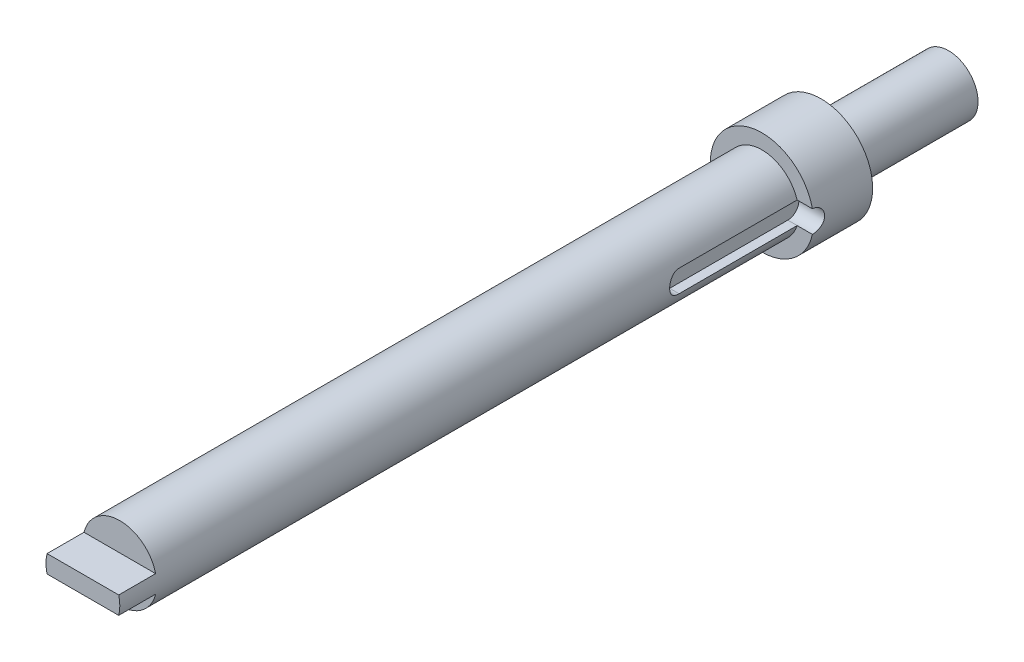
ISO-10303-21;
HEADER;
FILE_DESCRIPTION(('STEP AP214'),'2;1');
FILE_NAME('part.step','',(''),(''),'','','');
FILE_SCHEMA(('AUTOMOTIVE_DESIGN { 1 0 10303 214 1 1 1 1 }'));
ENDSEC;
DATA;
#1=APPLICATION_CONTEXT('core data for automotive mechanical design processes');
#2=APPLICATION_PROTOCOL_DEFINITION('international standard','automotive_design',2000,#1);
#3=PRODUCT_CONTEXT('',#1,'mechanical');
#4=PRODUCT('Part','Part','',(#3));
#5=PRODUCT_RELATED_PRODUCT_CATEGORY('part','',(#4));
#6=PRODUCT_DEFINITION_FORMATION('','',#4);
#7=PRODUCT_DEFINITION_CONTEXT('part definition',#1,'design');
#8=PRODUCT_DEFINITION('design','',#6,#7);
#9=PRODUCT_DEFINITION_SHAPE('','',#8);
#10=(LENGTH_UNIT() NAMED_UNIT(*) SI_UNIT(.MILLI.,.METRE.));
#11=(NAMED_UNIT(*) PLANE_ANGLE_UNIT() SI_UNIT($,.RADIAN.));
#12=(NAMED_UNIT(*) SI_UNIT($,.STERADIAN.) SOLID_ANGLE_UNIT());
#13=UNCERTAINTY_MEASURE_WITH_UNIT(LENGTH_MEASURE(1.E-05),#10,'distance_accuracy_value','');
#14=(GEOMETRIC_REPRESENTATION_CONTEXT(3) GLOBAL_UNCERTAINTY_ASSIGNED_CONTEXT((#13)) GLOBAL_UNIT_ASSIGNED_CONTEXT((#10,
#11,#12)) REPRESENTATION_CONTEXT('',''));
#15=CARTESIAN_POINT('',(0.,0.,0.));
#16=DIRECTION('',(0.,0.,1.));
#17=DIRECTION('',(1.,0.,0.));
#18=AXIS2_PLACEMENT_3D('',#15,#16,#17);
#19=CARTESIAN_POINT('',(0.,0.,138.1125));
#20=DIRECTION('',(0.,0.,1.));
#21=DIRECTION('',(1.,0.,0.));
#22=AXIS2_PLACEMENT_3D('',#19,#20,#21);
#23=PLANE('',#22);
#24=DIRECTION('',(-1.,0.,0.));
#25=VECTOR('',#24,1.);
#26=CARTESIAN_POINT('',(-7.70550979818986,1.905,138.1125));
#27=LINE('',#26,#25);
#28=CARTESIAN_POINT('',(7.70550979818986,1.905,138.1125));
#29=VERTEX_POINT('',#28);
#30=CARTESIAN_POINT('',(-7.70550979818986,1.905,138.1125));
#31=VERTEX_POINT('',#30);
#32=EDGE_CURVE('E140',#29,#31,#27,.T.);
#33=ORIENTED_EDGE('',*,*,#32,.F.);
#34=CARTESIAN_POINT('',(0.,0.,138.1125));
#35=DIRECTION('',(0.,0.,1.));
#36=DIRECTION('',(1.,0.,0.));
#37=AXIS2_PLACEMENT_3D('',#34,#35,#36);
#38=CIRCLE('',#37,7.9375);
#39=EDGE_CURVE('E72',#29,#31,#38,.T.);
#40=ORIENTED_EDGE('',*,*,#39,.T.);
#41=EDGE_LOOP('',(#33,#40));
#42=FACE_BOUND('',#41,.T.);
#43=ADVANCED_FACE('F46',(#42),#23,.T.);
#44=CARTESIAN_POINT('',(0.,0.,138.1125));
#45=DIRECTION('',(0.,0.,-1.));
#46=DIRECTION('',(-1.,0.,0.));
#47=AXIS2_PLACEMENT_3D('',#44,#45,#46);
#48=CYLINDRICAL_SURFACE('',#47,7.9375);
#49=ORIENTED_EDGE('',*,*,#39,.F.);
#50=DIRECTION('',(0.,0.,-1.));
#51=VECTOR('',#50,1.);
#52=CARTESIAN_POINT('',(7.70550979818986,1.905,146.05));
#53=LINE('',#52,#51);
#54=CARTESIAN_POINT('',(7.70550979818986,1.905,146.05));
#55=VERTEX_POINT('',#54);
#56=EDGE_CURVE('E149',#55,#29,#53,.T.);
#57=ORIENTED_EDGE('',*,*,#56,.F.);
#58=CARTESIAN_POINT('',(0.,0.,146.05));
#59=DIRECTION('',(0.,0.,1.));
#60=DIRECTION('',(-1.,0.,0.));
#61=AXIS2_PLACEMENT_3D('',#58,#59,#60);
#62=CIRCLE('',#61,7.9375);
#63=CARTESIAN_POINT('',(7.70550979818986,-1.905,146.05));
#64=VERTEX_POINT('',#63);
#65=EDGE_CURVE('E130',#64,#55,#62,.T.);
#66=ORIENTED_EDGE('',*,*,#65,.F.);
#67=DIRECTION('',(0.,0.,-1.));
#68=VECTOR('',#67,1.);
#69=CARTESIAN_POINT('',(7.70550979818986,-1.905,146.05));
#70=LINE('',#69,#68);
#71=CARTESIAN_POINT('',(7.70550979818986,-1.905,138.1125));
#72=VERTEX_POINT('',#71);
#73=EDGE_CURVE('E127',#64,#72,#70,.T.);
#74=ORIENTED_EDGE('',*,*,#73,.T.);
#75=CARTESIAN_POINT('',(-7.70550979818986,-1.905,138.1125));
#76=VERTEX_POINT('',#75);
#77=EDGE_CURVE('E143',#76,#72,#38,.T.);
#78=ORIENTED_EDGE('',*,*,#77,.F.);
#79=DIRECTION('',(0.,0.,-1.));
#80=VECTOR('',#79,1.);
#81=CARTESIAN_POINT('',(-7.70550979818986,-1.905,146.05));
#82=LINE('',#81,#80);
#83=CARTESIAN_POINT('',(-7.70550979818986,-1.905,146.05));
#84=VERTEX_POINT('',#83);
#85=EDGE_CURVE('E125',#84,#76,#82,.T.);
#86=ORIENTED_EDGE('',*,*,#85,.F.);
#87=CARTESIAN_POINT('',(0.,0.,146.05));
#88=DIRECTION('',(0.,0.,1.));
#89=DIRECTION('',(-1.,0.,0.));
#90=AXIS2_PLACEMENT_3D('',#87,#88,#89);
#91=CIRCLE('',#90,7.9375);
#92=CARTESIAN_POINT('',(-7.70550979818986,1.905,146.05));
#93=VERTEX_POINT('',#92);
#94=EDGE_CURVE('E131',#93,#84,#91,.T.);
#95=ORIENTED_EDGE('',*,*,#94,.F.);
#96=DIRECTION('',(0.,0.,-1.));
#97=VECTOR('',#96,1.);
#98=CARTESIAN_POINT('',(-7.70550979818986,1.905,146.05));
#99=LINE('',#98,#97);
#100=EDGE_CURVE('E226',#93,#31,#99,.T.);
#101=ORIENTED_EDGE('',*,*,#100,.T.);
#102=EDGE_LOOP('',(#49,#57,#66,#74,#78,#86,#95,#101));
#103=FACE_BOUND('',#102,.T.);
#104=DIRECTION('',(0.,0.,-1.));
#105=VECTOR('',#104,1.);
#106=CARTESIAN_POINT('',(7.57189241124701,-2.38125,138.1125));
#107=LINE('',#106,#105);
#108=CARTESIAN_POINT('',(7.57189241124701,-2.38125,25.4));
#109=VERTEX_POINT('',#108);
#110=CARTESIAN_POINT('',(7.57189241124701,-2.38125,0.));
#111=VERTEX_POINT('',#110);
#112=EDGE_CURVE('E184',#109,#111,#107,.T.);
#113=ORIENTED_EDGE('',*,*,#112,.F.);
#114=CARTESIAN_POINT('',(7.57189241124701,2.38125,25.4));
#115=CARTESIAN_POINT('',(7.57188330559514,2.38125815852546,25.465353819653));
#116=CARTESIAN_POINT('',(7.572738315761,2.378559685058,25.5307024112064));
#117=CARTESIAN_POINT('',(7.57610889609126,2.36781294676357,25.6609008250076));
#118=CARTESIAN_POINT('',(7.57862409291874,2.35976588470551,25.7257507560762));
#119=CARTESIAN_POINT('',(7.58523905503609,2.3384124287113,25.8543305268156));
#120=CARTESIAN_POINT('',(7.58933479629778,2.32511938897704,25.9180627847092));
#121=CARTESIAN_POINT('',(7.59897853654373,2.29340452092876,26.0441089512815));
#122=CARTESIAN_POINT('',(7.60452657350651,2.27498255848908,26.1064228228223));
#123=CARTESIAN_POINT('',(7.62310862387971,2.21224938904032,26.2905473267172));
#124=CARTESIAN_POINT('',(7.63808962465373,2.16044345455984,26.4097043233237));
#125=CARTESIAN_POINT('',(7.67153988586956,2.0384694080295,26.6376356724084));
#126=CARTESIAN_POINT('',(7.69001076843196,1.96829275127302,26.7464051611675));
#127=CARTESIAN_POINT('',(7.72901085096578,1.80919341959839,26.9539426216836));
#128=CARTESIAN_POINT('',(7.74958369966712,1.71979363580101,27.0523373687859));
#129=CARTESIAN_POINT('',(7.79009767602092,1.52580765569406,27.2329859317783));
#130=CARTESIAN_POINT('',(7.81003869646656,1.4212188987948,27.3152370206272));
#131=CARTESIAN_POINT('',(7.84754016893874,1.19714960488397,27.4628981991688));
#132=CARTESIAN_POINT('',(7.86504286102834,1.07740582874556,27.5279248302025));
#133=CARTESIAN_POINT('',(7.89518471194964,0.828073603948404,27.6367692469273));
#134=CARTESIAN_POINT('',(7.9078251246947,0.698487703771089,27.6805925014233));
#135=CARTESIAN_POINT('',(7.92650878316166,0.437077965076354,27.7445466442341));
#136=CARTESIAN_POINT('',(7.93273034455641,0.305424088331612,27.7653192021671));
#137=CARTESIAN_POINT('',(7.93850333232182,0.040359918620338,27.7846112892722));
#138=CARTESIAN_POINT('',(7.93805602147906,-0.0930500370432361,27.7831350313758));
#139=CARTESIAN_POINT('',(7.93066744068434,-0.353332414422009,27.7584012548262));
#140=CARTESIAN_POINT('',(7.92393347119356,-0.480277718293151,27.7358390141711));
#141=CARTESIAN_POINT('',(7.90498028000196,-0.728487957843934,27.6707097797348));
#142=CARTESIAN_POINT('',(7.89276077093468,-0.849752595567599,27.6281417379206));
#143=CARTESIAN_POINT('',(7.86392278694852,-1.08481465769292,27.5237380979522));
#144=CARTESIAN_POINT('',(7.84725468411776,-1.19850853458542,27.461683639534));
#145=CARTESIAN_POINT('',(7.8112877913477,-1.41409027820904,27.3202422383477));
#146=CARTESIAN_POINT('',(7.79198841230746,-1.5159754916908,27.2408514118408));
#147=CARTESIAN_POINT('',(7.75194781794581,-1.70918902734,27.0633952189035));
#148=CARTESIAN_POINT('',(7.73117969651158,-1.79996070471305,26.9647291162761));
#149=CARTESIAN_POINT('',(7.69118691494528,-1.96384496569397,26.7533478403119));
#150=CARTESIAN_POINT('',(7.67196270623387,-2.0369523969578,26.6406285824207));
#151=CARTESIAN_POINT('',(7.63710100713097,-2.1640229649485,26.4028540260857));
#152=CARTESIAN_POINT('',(7.62150171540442,-2.21778522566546,26.2776856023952));
#153=CARTESIAN_POINT('',(7.59611866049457,-2.30323844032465,26.0195623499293));
#154=CARTESIAN_POINT('',(7.58632600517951,-2.33496315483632,25.886619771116));
#155=CARTESIAN_POINT('',(7.57736026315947,-2.36380660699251,25.6936956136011));
#156=CARTESIAN_POINT('',(7.57531435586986,-2.37034709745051,25.6351234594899));
#157=CARTESIAN_POINT('',(7.57258024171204,-2.37906489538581,25.5177107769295));
#158=CARTESIAN_POINT('',(7.57189003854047,-2.38124861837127,25.4588707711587));
#159=CARTESIAN_POINT('',(7.57189241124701,-2.38125,25.4));
#160=B_SPLINE_CURVE_WITH_KNOTS('',3,(#114,#115,#116,#117,#118,#119,#120,#121,#122,#123,#124,
#125,#126,#127,#128,#129,#130,#131,#132,#133,#134,#135,#136,#137,#138,#139,#140,#141,#142,#143,
#144,#145,#146,#147,#148,#149,#150,#151,#152,#153,#154,#155,#156,#157,#158,#159),.UNSPECIFIED.,
.F.,.F.,(4,2,2,2,2,2,2,2,2,2,2,2,2,2,2,2,2,2,2,2,2,2,4),(0.,0.195991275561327,0.391938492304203,
0.587390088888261,0.782846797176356,1.17326844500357,1.5638720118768,1.96560376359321,
2.36740331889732,2.77751230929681,3.18751546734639,3.58579420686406,3.98399753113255,
4.36951721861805,4.7550571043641,5.14509213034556,5.53521462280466,5.94033955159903,
6.34558250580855,6.7549196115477,7.16362823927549,7.34039575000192,7.51690277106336),.UNSPECIFIED.);
#161=CARTESIAN_POINT('',(7.57189241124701,2.38125,25.4));
#162=VERTEX_POINT('',#161);
#163=EDGE_CURVE('E12',#162,#109,#160,.T.);
#164=ORIENTED_EDGE('',*,*,#163,.F.);
#165=DIRECTION('',(0.,0.,-1.));
#166=VECTOR('',#165,1.);
#167=CARTESIAN_POINT('',(7.57189241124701,2.38125,138.1125));
#168=LINE('',#167,#166);
#169=CARTESIAN_POINT('',(7.57189241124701,2.38125,0.));
#170=VERTEX_POINT('',#169);
#171=EDGE_CURVE('E175',#170,#162,#168,.F.);
#172=ORIENTED_EDGE('',*,*,#171,.F.);
#173=CARTESIAN_POINT('',(0.,0.,0.));
#174=DIRECTION('',(0.,0.,-1.));
#175=DIRECTION('',(-1.,0.,0.));
#176=AXIS2_PLACEMENT_3D('',#173,#174,#175);
#177=CIRCLE('',#176,7.9375);
#178=EDGE_CURVE('E270',#111,#170,#177,.T.);
#179=ORIENTED_EDGE('',*,*,#178,.F.);
#180=EDGE_LOOP('',(#113,#164,#172,#179));
#181=FACE_BOUND('',#180,.T.);
#182=ADVANCED_FACE('F48',(#103,#181),#48,.T.);
#183=CARTESIAN_POINT('',(0.,0.,-12.7));
#184=DIRECTION('',(0.,0.,1.));
#185=DIRECTION('',(1.,0.,0.));
#186=AXIS2_PLACEMENT_3D('',#183,#184,#185);
#187=CYLINDRICAL_SURFACE('',#186,11.1125);
#188=CARTESIAN_POINT('',(0.,0.,-12.7));
#189=DIRECTION('',(0.,0.,-1.));
#190=DIRECTION('',(-1.,0.,0.));
#191=AXIS2_PLACEMENT_3D('',#188,#189,#190);
#192=CIRCLE('',#191,11.1125);
#193=CARTESIAN_POINT('',(-11.1125,0.,-12.7));
#194=VERTEX_POINT('',#193);
#195=EDGE_CURVE('E274',#194,#194,#192,.T.);
#196=ORIENTED_EDGE('',*,*,#195,.F.);
#197=EDGE_LOOP('',(#196));
#198=FACE_BOUND('',#197,.T.);
#199=CARTESIAN_POINT('',(10.854368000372,-2.38125,0.));
#200=CARTESIAN_POINT('',(10.8543618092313,-2.38125730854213,-0.066153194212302));
#201=CARTESIAN_POINT('',(10.8549726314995,-2.37849340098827,-0.132302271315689));
#202=CARTESIAN_POINT('',(10.8573824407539,-2.36747986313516,-0.264111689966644));
#203=CARTESIAN_POINT('',(10.8591812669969,-2.35923097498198,-0.329772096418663));
#204=CARTESIAN_POINT('',(10.8639173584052,-2.33732213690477,-0.460034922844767));
#205=CARTESIAN_POINT('',(10.8668527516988,-2.32367108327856,-0.524638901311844));
#206=CARTESIAN_POINT('',(10.8737703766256,-2.29108037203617,-0.652423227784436));
#207=CARTESIAN_POINT('',(10.8777526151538,-2.27214067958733,-0.715603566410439));
#208=CARTESIAN_POINT('',(10.8911063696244,-2.20758188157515,-0.902353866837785));
#209=CARTESIAN_POINT('',(10.901889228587,-2.15420434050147,-1.02324348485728));
#210=CARTESIAN_POINT('',(10.9259934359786,-2.02839812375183,-1.25430846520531));
#211=CARTESIAN_POINT('',(10.9393151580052,-1.95596664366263,-1.36448224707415));
#212=CARTESIAN_POINT('',(10.9672363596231,-1.79285004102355,-1.57282654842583));
#213=CARTESIAN_POINT('',(10.9818515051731,-1.70191656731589,-1.67080088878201));
#214=CARTESIAN_POINT('',(11.0105765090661,-1.50490975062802,-1.85023180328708));
#215=CARTESIAN_POINT('',(11.0246862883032,-1.39883405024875,-1.93168580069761));
#216=CARTESIAN_POINT('',(11.0509810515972,-1.17323464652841,-2.07653956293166));
#217=CARTESIAN_POINT('',(11.063145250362,-1.05358642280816,-2.13974951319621));
#218=CARTESIAN_POINT('',(11.0839996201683,-0.805068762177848,-2.24508881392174));
#219=CARTESIAN_POINT('',(11.0926903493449,-0.676200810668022,-2.28722155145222));
#220=CARTESIAN_POINT('',(11.1055080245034,-0.414953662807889,-2.34859469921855));
#221=CARTESIAN_POINT('',(11.1097016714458,-0.282656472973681,-2.36817001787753));
#222=CARTESIAN_POINT('',(11.1132836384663,-0.0165907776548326,-2.38491922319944));
#223=CARTESIAN_POINT('',(11.1126723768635,0.11717759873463,-2.38209505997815));
#224=CARTESIAN_POINT('',(11.1067643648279,0.380075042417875,-2.3543752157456));
#225=CARTESIAN_POINT('',(11.1015443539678,0.509244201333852,-2.32984101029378));
#226=CARTESIAN_POINT('',(11.0870926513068,0.761587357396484,-2.25997308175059));
#227=CARTESIAN_POINT('',(11.0778608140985,0.884761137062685,-2.21463860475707));
#228=CARTESIAN_POINT('',(11.0562984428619,1.12263018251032,-2.10413289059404));
#229=CARTESIAN_POINT('',(11.043946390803,1.23725910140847,-2.03882320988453));
#230=CARTESIAN_POINT('',(11.0175003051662,1.45405929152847,-1.89032575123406));
#231=CARTESIAN_POINT('',(11.0034060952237,1.55622929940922,-1.80713616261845));
#232=CARTESIAN_POINT('',(10.9746961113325,1.74735249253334,-1.62328077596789));
#233=CARTESIAN_POINT('',(10.9600755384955,1.83600274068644,-1.52230058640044));
#234=CARTESIAN_POINT('',(10.9322199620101,1.99518803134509,-1.30672460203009));
#235=CARTESIAN_POINT('',(10.9189853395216,2.06571809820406,-1.19212508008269));
#236=CARTESIAN_POINT('',(10.8953858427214,2.18679116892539,-0.952069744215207));
#237=CARTESIAN_POINT('',(10.8850305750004,2.23726750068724,-0.826579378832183));
#238=CARTESIAN_POINT('',(10.8684986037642,2.31625785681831,-0.568703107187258));
#239=CARTESIAN_POINT('',(10.8623156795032,2.34480458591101,-0.436327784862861));
#240=CARTESIAN_POINT('',(10.8571845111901,2.36838059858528,-0.252391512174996));
#241=CARTESIAN_POINT('',(10.8561295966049,2.37320809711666,-0.201996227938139));
#242=CARTESIAN_POINT('',(10.8547218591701,2.37963885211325,-0.101074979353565));
#243=CARTESIAN_POINT('',(10.8543678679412,2.38124747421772,-0.0505493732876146));
#244=CARTESIAN_POINT('',(10.854368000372,2.38125,0.));
#245=B_SPLINE_CURVE_WITH_KNOTS('',3,(#199,#200,#201,#202,#203,#204,#205,#206,#207,#208,#209,
#210,#211,#212,#213,#214,#215,#216,#217,#218,#219,#220,#221,#222,#223,#224,#225,#226,#227,#228,
#229,#230,#231,#232,#233,#234,#235,#236,#237,#238,#239,#240,#241,#242,#243,#244),.UNSPECIFIED.,
.F.,.F.,(4,2,2,2,2,2,2,2,2,2,2,2,2,2,2,2,2,2,2,2,2,2,4),(0.,0.198391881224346,0.396756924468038,
0.594796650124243,0.792837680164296,1.18858787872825,1.58439635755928,1.98591716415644,
2.38750054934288,2.79312275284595,3.19867975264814,3.5981345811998,3.99755463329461,
4.39044684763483,4.78335330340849,5.1790470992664,5.57478098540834,5.97837765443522,
6.38208502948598,6.78712358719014,7.19155691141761,7.34338415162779,7.4949580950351),.UNSPECIFIED.);
#246=CARTESIAN_POINT('',(10.854368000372,-2.38125,0.));
#247=VERTEX_POINT('',#246);
#248=CARTESIAN_POINT('',(10.854368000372,2.38125,0.));
#249=VERTEX_POINT('',#248);
#250=EDGE_CURVE('E177',#247,#249,#245,.T.);
#251=ORIENTED_EDGE('',*,*,#250,.F.);
#252=CARTESIAN_POINT('',(0.,0.,0.));
#253=DIRECTION('',(0.,0.,-1.));
#254=DIRECTION('',(-1.,0.,0.));
#255=AXIS2_PLACEMENT_3D('',#252,#253,#254);
#256=CIRCLE('',#255,11.1125);
#257=EDGE_CURVE('E277',#247,#249,#256,.T.);
#258=ORIENTED_EDGE('',*,*,#257,.T.);
#259=EDGE_LOOP('',(#251,#258));
#260=FACE_BOUND('',#259,.T.);
#261=ADVANCED_FACE('F186',(#198,#260),#187,.T.);
#262=CARTESIAN_POINT('',(0.,0.,0.));
#263=DIRECTION('',(0.,0.,-1.));
#264=DIRECTION('',(-1.,0.,0.));
#265=AXIS2_PLACEMENT_3D('',#262,#263,#264);
#266=PLANE('',#265);
#267=DIRECTION('',(-1.,0.,0.));
#268=VECTOR('',#267,1.);
#269=CARTESIAN_POINT('',(11.1125,-2.38125,0.));
#270=LINE('',#269,#268);
#271=EDGE_CURVE('E59',#111,#247,#270,.F.);
#272=ORIENTED_EDGE('',*,*,#271,.F.);
#273=ORIENTED_EDGE('',*,*,#178,.T.);
#274=DIRECTION('',(-1.,0.,0.));
#275=VECTOR('',#274,1.);
#276=CARTESIAN_POINT('',(0.,2.38125,0.));
#277=LINE('',#276,#275);
#278=EDGE_CURVE('E227',#249,#170,#277,.T.);
#279=ORIENTED_EDGE('',*,*,#278,.F.);
#280=ORIENTED_EDGE('',*,*,#257,.F.);
#281=EDGE_LOOP('',(#272,#273,#279,#280));
#282=FACE_BOUND('',#281,.T.);
#283=ADVANCED_FACE('F209',(#282),#266,.F.);
#284=DIRECTION('',(1.,0.,0.));
#285=VECTOR('',#284,1.);
#286=CARTESIAN_POINT('',(-7.70550979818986,-1.905,138.1125));
#287=LINE('',#286,#285);
#288=EDGE_CURVE('E65',#76,#72,#287,.T.);
#289=ORIENTED_EDGE('',*,*,#288,.F.);
#290=ORIENTED_EDGE('',*,*,#77,.T.);
#291=EDGE_LOOP('',(#289,#290));
#292=FACE_BOUND('',#291,.T.);
#293=ADVANCED_FACE('F207',(#292),#23,.T.);
#294=CARTESIAN_POINT('',(0.,0.,-12.7));
#295=DIRECTION('',(0.,0.,-1.));
#296=DIRECTION('',(-1.,0.,0.));
#297=AXIS2_PLACEMENT_3D('',#294,#295,#296);
#298=PLANE('',#297);
#299=CARTESIAN_POINT('',(0.,0.,-12.7));
#300=DIRECTION('',(0.,0.,-1.));
#301=DIRECTION('',(-1.,0.,0.));
#302=AXIS2_PLACEMENT_3D('',#299,#300,#301);
#303=CIRCLE('',#302,6.35);
#304=CARTESIAN_POINT('',(-6.35,0.,-12.7));
#305=VERTEX_POINT('',#304);
#306=EDGE_CURVE('E144',#305,#305,#303,.T.);
#307=ORIENTED_EDGE('',*,*,#306,.F.);
#308=EDGE_LOOP('',(#307));
#309=FACE_BOUND('',#308,.T.);
#310=ORIENTED_EDGE('',*,*,#195,.T.);
#311=EDGE_LOOP('',(#310));
#312=FACE_BOUND('',#311,.T.);
#313=ADVANCED_FACE('F204',(#309,#312),#298,.T.);
#314=CARTESIAN_POINT('',(11.1125,0.,25.4));
#315=DIRECTION('',(-1.,0.,0.));
#316=DIRECTION('',(0.,0.,1.));
#317=AXIS2_PLACEMENT_3D('',#314,#315,#316);
#318=CYLINDRICAL_SURFACE('',#317,2.38125);
#319=ORIENTED_EDGE('',*,*,#163,.T.);
#320=DIRECTION('',(-1.,0.,0.));
#321=VECTOR('',#320,1.);
#322=CARTESIAN_POINT('',(11.1125,-2.38125,25.4));
#323=LINE('',#322,#321);
#324=CARTESIAN_POINT('',(5.55625,-2.38125,25.4));
#325=VERTEX_POINT('',#324);
#326=EDGE_CURVE('E173',#109,#325,#323,.T.);
#327=ORIENTED_EDGE('',*,*,#326,.T.);
#328=CARTESIAN_POINT('',(5.55625,0.,25.4));
#329=DIRECTION('',(1.,0.,0.));
#330=DIRECTION('',(0.,0.,-1.));
#331=AXIS2_PLACEMENT_3D('',#328,#329,#330);
#332=CIRCLE('',#331,2.38125);
#333=CARTESIAN_POINT('',(5.55625,2.38125,25.4));
#334=VERTEX_POINT('',#333);
#335=EDGE_CURVE('E154',#334,#325,#332,.T.);
#336=ORIENTED_EDGE('',*,*,#335,.F.);
#337=DIRECTION('',(-1.,0.,0.));
#338=VECTOR('',#337,1.);
#339=CARTESIAN_POINT('',(11.1125,2.38125,25.4));
#340=LINE('',#339,#338);
#341=EDGE_CURVE('E167',#162,#334,#340,.T.);
#342=ORIENTED_EDGE('',*,*,#341,.F.);
#343=EDGE_LOOP('',(#319,#327,#336,#342));
#344=FACE_BOUND('',#343,.T.);
#345=ADVANCED_FACE('F199',(#344),#318,.F.);
#346=CARTESIAN_POINT('',(11.1125,-2.38125,25.4));
#347=DIRECTION('',(0.,1.,0.));
#348=DIRECTION('',(0.,0.,1.));
#349=AXIS2_PLACEMENT_3D('',#346,#347,#348);
#350=PLANE('',#349);
#351=ORIENTED_EDGE('',*,*,#112,.T.);
#352=DIRECTION('',(-1.,0.,0.));
#353=VECTOR('',#352,1.);
#354=CARTESIAN_POINT('',(11.1125,-2.38125,0.));
#355=LINE('',#354,#353);
#356=CARTESIAN_POINT('',(5.55625,-2.38125,0.));
#357=VERTEX_POINT('',#356);
#358=EDGE_CURVE('E171',#111,#357,#355,.T.);
#359=ORIENTED_EDGE('',*,*,#358,.T.);
#360=DIRECTION('',(0.,0.,-1.));
#361=VECTOR('',#360,1.);
#362=CARTESIAN_POINT('',(5.55625,-2.38125,25.4));
#363=LINE('',#362,#361);
#364=EDGE_CURVE('E158',#325,#357,#363,.T.);
#365=ORIENTED_EDGE('',*,*,#364,.F.);
#366=ORIENTED_EDGE('',*,*,#326,.F.);
#367=EDGE_LOOP('',(#351,#359,#365,#366));
#368=FACE_BOUND('',#367,.T.);
#369=ADVANCED_FACE('F195',(#368),#350,.T.);
#370=CARTESIAN_POINT('',(11.1125,0.,0.));
#371=DIRECTION('',(-1.,0.,0.));
#372=DIRECTION('',(0.,0.,1.));
#373=AXIS2_PLACEMENT_3D('',#370,#371,#372);
#374=CYLINDRICAL_SURFACE('',#373,2.38125);
#375=ORIENTED_EDGE('',*,*,#250,.T.);
#376=ORIENTED_EDGE('',*,*,#278,.T.);
#377=DIRECTION('',(-1.,0.,0.));
#378=VECTOR('',#377,1.);
#379=CARTESIAN_POINT('',(11.1125,2.38125,0.));
#380=LINE('',#379,#378);
#381=CARTESIAN_POINT('',(5.55625,2.38125,0.));
#382=VERTEX_POINT('',#381);
#383=EDGE_CURVE('E169',#170,#382,#380,.T.);
#384=ORIENTED_EDGE('',*,*,#383,.T.);
#385=CARTESIAN_POINT('',(5.55625,0.,0.));
#386=DIRECTION('',(1.,0.,0.));
#387=DIRECTION('',(0.,0.,-1.));
#388=AXIS2_PLACEMENT_3D('',#385,#386,#387);
#389=CIRCLE('',#388,2.38125);
#390=EDGE_CURVE('E161',#357,#382,#389,.T.);
#391=ORIENTED_EDGE('',*,*,#390,.F.);
#392=ORIENTED_EDGE('',*,*,#358,.F.);
#393=ORIENTED_EDGE('',*,*,#271,.T.);
#394=EDGE_LOOP('',(#375,#376,#384,#391,#392,#393));
#395=FACE_BOUND('',#394,.T.);
#396=ADVANCED_FACE('F189',(#395),#374,.F.);
#397=CARTESIAN_POINT('',(11.1125,2.38125,25.4));
#398=DIRECTION('',(0.,-1.,0.));
#399=DIRECTION('',(0.,0.,-1.));
#400=AXIS2_PLACEMENT_3D('',#397,#398,#399);
#401=PLANE('',#400);
#402=ORIENTED_EDGE('',*,*,#171,.T.);
#403=ORIENTED_EDGE('',*,*,#341,.T.);
#404=DIRECTION('',(0.,0.,1.));
#405=VECTOR('',#404,1.);
#406=CARTESIAN_POINT('',(5.55625,2.38125,25.4));
#407=LINE('',#406,#405);
#408=EDGE_CURVE('E164',#382,#334,#407,.T.);
#409=ORIENTED_EDGE('',*,*,#408,.F.);
#410=ORIENTED_EDGE('',*,*,#383,.F.);
#411=EDGE_LOOP('',(#402,#403,#409,#410));
#412=FACE_BOUND('',#411,.T.);
#413=ADVANCED_FACE('F194',(#412),#401,.T.);
#414=CARTESIAN_POINT('',(5.55625,0.,25.4));
#415=DIRECTION('',(1.,0.,0.));
#416=DIRECTION('',(0.,0.,-1.));
#417=AXIS2_PLACEMENT_3D('',#414,#415,#416);
#418=PLANE('',#417);
#419=ORIENTED_EDGE('',*,*,#335,.T.);
#420=ORIENTED_EDGE('',*,*,#364,.T.);
#421=ORIENTED_EDGE('',*,*,#390,.T.);
#422=ORIENTED_EDGE('',*,*,#408,.T.);
#423=EDGE_LOOP('',(#419,#420,#421,#422));
#424=FACE_BOUND('',#423,.T.);
#425=ADVANCED_FACE('F249',(#424),#418,.T.);
#426=CARTESIAN_POINT('',(0.,0.,-40.132));
#427=DIRECTION('',(0.,0.,1.));
#428=DIRECTION('',(1.,0.,0.));
#429=AXIS2_PLACEMENT_3D('',#426,#427,#428);
#430=CYLINDRICAL_SURFACE('',#429,6.35);
#431=CARTESIAN_POINT('',(0.,0.,-40.132));
#432=DIRECTION('',(0.,0.,-1.));
#433=DIRECTION('',(-1.,0.,0.));
#434=AXIS2_PLACEMENT_3D('',#431,#432,#433);
#435=CIRCLE('',#434,6.35);
#436=CARTESIAN_POINT('',(-6.35,0.,-40.132));
#437=VERTEX_POINT('',#436);
#438=EDGE_CURVE('E147',#437,#437,#435,.T.);
#439=ORIENTED_EDGE('',*,*,#438,.F.);
#440=EDGE_LOOP('',(#439));
#441=FACE_BOUND('',#440,.T.);
#442=ORIENTED_EDGE('',*,*,#306,.T.);
#443=EDGE_LOOP('',(#442));
#444=FACE_BOUND('',#443,.T.);
#445=ADVANCED_FACE('F246',(#441,#444),#430,.T.);
#446=CARTESIAN_POINT('',(0.,0.,-40.132));
#447=DIRECTION('',(0.,0.,-1.));
#448=DIRECTION('',(-1.,0.,0.));
#449=AXIS2_PLACEMENT_3D('',#446,#447,#448);
#450=PLANE('',#449);
#451=ORIENTED_EDGE('',*,*,#438,.T.);
#452=EDGE_LOOP('',(#451));
#453=FACE_BOUND('',#452,.T.);
#454=ADVANCED_FACE('F241',(#453),#450,.T.);
#455=CARTESIAN_POINT('',(-7.70550979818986,-1.905,146.05));
#456=DIRECTION('',(0.,1.,0.));
#457=DIRECTION('',(0.,0.,1.));
#458=AXIS2_PLACEMENT_3D('',#455,#456,#457);
#459=PLANE('',#458);
#460=ORIENTED_EDGE('',*,*,#288,.T.);
#461=ORIENTED_EDGE('',*,*,#73,.F.);
#462=DIRECTION('',(1.,0.,0.));
#463=VECTOR('',#462,1.);
#464=CARTESIAN_POINT('',(-7.70550979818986,-1.905,146.05));
#465=LINE('',#464,#463);
#466=EDGE_CURVE('E121',#84,#64,#465,.T.);
#467=ORIENTED_EDGE('',*,*,#466,.F.);
#468=ORIENTED_EDGE('',*,*,#85,.T.);
#469=EDGE_LOOP('',(#460,#461,#467,#468));
#470=FACE_BOUND('',#469,.T.);
#471=ADVANCED_FACE('F123',(#470),#459,.F.);
#472=CARTESIAN_POINT('',(-7.70550979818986,1.905,146.05));
#473=DIRECTION('',(0.,-1.,0.));
#474=DIRECTION('',(0.,0.,-1.));
#475=AXIS2_PLACEMENT_3D('',#472,#473,#474);
#476=PLANE('',#475);
#477=ORIENTED_EDGE('',*,*,#32,.T.);
#478=ORIENTED_EDGE('',*,*,#100,.F.);
#479=DIRECTION('',(-1.,0.,0.));
#480=VECTOR('',#479,1.);
#481=CARTESIAN_POINT('',(-7.70550979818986,1.905,146.05));
#482=LINE('',#481,#480);
#483=EDGE_CURVE('E136',#55,#93,#482,.T.);
#484=ORIENTED_EDGE('',*,*,#483,.F.);
#485=ORIENTED_EDGE('',*,*,#56,.T.);
#486=EDGE_LOOP('',(#477,#478,#484,#485));
#487=FACE_BOUND('',#486,.T.);
#488=ADVANCED_FACE('F229',(#487),#476,.F.);
#489=CARTESIAN_POINT('',(0.,0.,146.05));
#490=DIRECTION('',(0.,0.,-1.));
#491=DIRECTION('',(-1.,0.,0.));
#492=AXIS2_PLACEMENT_3D('',#489,#490,#491);
#493=PLANE('',#492);
#494=ORIENTED_EDGE('',*,*,#94,.T.);
#495=ORIENTED_EDGE('',*,*,#466,.T.);
#496=ORIENTED_EDGE('',*,*,#65,.T.);
#497=ORIENTED_EDGE('',*,*,#483,.T.);
#498=EDGE_LOOP('',(#494,#495,#496,#497));
#499=FACE_BOUND('',#498,.T.);
#500=ADVANCED_FACE('F134',(#499),#493,.F.);
#501=CLOSED_SHELL('',(#43,#182,#261,#283,#293,#313,#345,#369,#396,#413,#425,#445,#454,#471,#488,#500));
#502=MANIFOLD_SOLID_BREP('B2',#501);
#503=ADVANCED_BREP_SHAPE_REPRESENTATION('',(#18,#502),#14);
#504=SHAPE_DEFINITION_REPRESENTATION(#9,#503);
ENDSEC;
END-ISO-10303-21;
